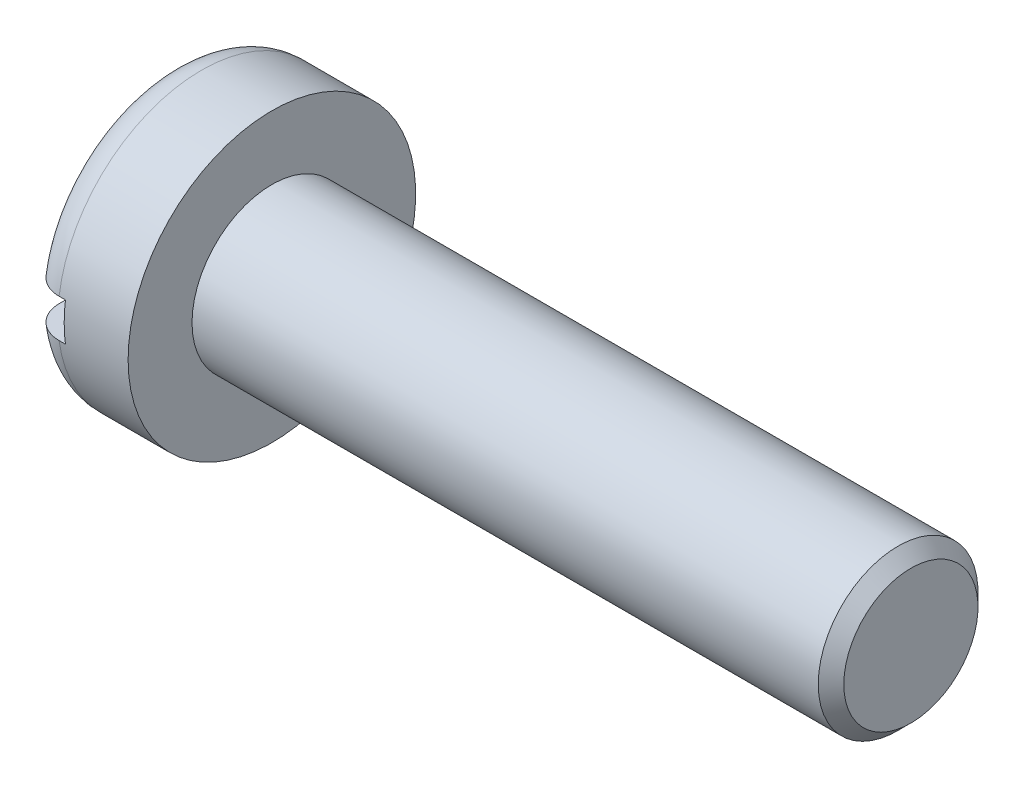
ISO-10303-21;
HEADER;
FILE_DESCRIPTION(('STEP AP214'),'2;1');
FILE_NAME('part.step','',(''),(''),'','','');
FILE_SCHEMA(('AUTOMOTIVE_DESIGN { 1 0 10303 214 1 1 1 1 }'));
ENDSEC;
DATA;
#1=APPLICATION_CONTEXT('core data for automotive mechanical design processes');
#2=APPLICATION_PROTOCOL_DEFINITION('international standard','automotive_design',2000,#1);
#3=PRODUCT_CONTEXT('',#1,'mechanical');
#4=PRODUCT('Part','Part','',(#3));
#5=PRODUCT_RELATED_PRODUCT_CATEGORY('part','',(#4));
#6=PRODUCT_DEFINITION_FORMATION('','',#4);
#7=PRODUCT_DEFINITION_CONTEXT('part definition',#1,'design');
#8=PRODUCT_DEFINITION('design','',#6,#7);
#9=PRODUCT_DEFINITION_SHAPE('','',#8);
#10=(LENGTH_UNIT() NAMED_UNIT(*) SI_UNIT(.MILLI.,.METRE.));
#11=(NAMED_UNIT(*) PLANE_ANGLE_UNIT() SI_UNIT($,.RADIAN.));
#12=(NAMED_UNIT(*) SI_UNIT($,.STERADIAN.) SOLID_ANGLE_UNIT());
#13=UNCERTAINTY_MEASURE_WITH_UNIT(LENGTH_MEASURE(1.E-05),#10,'distance_accuracy_value','');
#14=(GEOMETRIC_REPRESENTATION_CONTEXT(3) GLOBAL_UNCERTAINTY_ASSIGNED_CONTEXT((#13)) GLOBAL_UNIT_ASSIGNED_CONTEXT((#10,
#11,#12)) REPRESENTATION_CONTEXT('',''));
#15=CARTESIAN_POINT('',(0.,0.,0.));
#16=DIRECTION('',(0.,0.,1.));
#17=DIRECTION('',(1.,0.,0.));
#18=AXIS2_PLACEMENT_3D('',#15,#16,#17);
#19=CARTESIAN_POINT('',(-1.6,0.,0.));
#20=DIRECTION('',(1.,0.,0.));
#21=DIRECTION('',(0.,0.,-1.));
#22=AXIS2_PLACEMENT_3D('',#19,#20,#21);
#23=PLANE('',#22);
#24=CARTESIAN_POINT('',(-1.6,0.,0.));
#25=DIRECTION('',(1.,0.,0.));
#26=DIRECTION('',(0.,0.,-1.));
#27=AXIS2_PLACEMENT_3D('',#24,#25,#26);
#28=CIRCLE('',#27,1.75);
#29=CARTESIAN_POINT('',(-1.6,0.3,1.72409396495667));
#30=VERTEX_POINT('',#29);
#31=CARTESIAN_POINT('',(-1.6,0.3,-1.72409396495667));
#32=VERTEX_POINT('',#31);
#33=EDGE_CURVE('E129',#30,#32,#28,.F.);
#34=ORIENTED_EDGE('',*,*,#33,.T.);
#35=DIRECTION('',(0.,0.,1.));
#36=VECTOR('',#35,1.);
#37=CARTESIAN_POINT('',(-1.6,0.3,0.));
#38=LINE('',#37,#36);
#39=EDGE_CURVE('E105',#32,#30,#38,.T.);
#40=ORIENTED_EDGE('',*,*,#39,.T.);
#41=EDGE_LOOP('',(#34,#40));
#42=FACE_BOUND('',#41,.T.);
#43=ADVANCED_FACE('F32',(#42),#23,.F.);
#44=CARTESIAN_POINT('',(-1.1,0.,0.));
#45=DIRECTION('',(1.,0.,0.));
#46=DIRECTION('',(0.,0.,-1.));
#47=AXIS2_PLACEMENT_3D('',#44,#45,#46);
#48=TOROIDAL_SURFACE('',#47,1.75,0.5);
#49=CARTESIAN_POINT('',(-1.37484515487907,0.3,-2.14682441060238));
#50=CARTESIAN_POINT('',(-1.35159837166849,0.3,-2.16226847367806));
#51=CARTESIAN_POINT('',(-1.32703674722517,0.3,-2.17576843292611));
#52=CARTESIAN_POINT('',(-1.27597711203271,0.3,-2.19846715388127));
#53=CARTESIAN_POINT('',(-1.2494769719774,0.3,-2.2076611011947));
#54=CARTESIAN_POINT('',(-1.19531286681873,0.3,-2.22145970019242));
#55=CARTESIAN_POINT('',(-1.16764923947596,0.3,-2.22606567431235));
#56=CARTESIAN_POINT('',(-1.11194836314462,0.3,-2.23055342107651));
#57=CARTESIAN_POINT('',(-1.08391120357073,0.3,-2.23043630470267));
#58=CARTESIAN_POINT('',(-1.02832256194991,0.3,-2.22549062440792));
#59=CARTESIAN_POINT('',(-1.00077008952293,0.3,-2.22067318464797));
#60=CARTESIAN_POINT('',(-0.946863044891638,0.3,-2.20648531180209));
#61=CARTESIAN_POINT('',(-0.9205085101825,0.3,-2.19711473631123));
#62=CARTESIAN_POINT('',(-0.869713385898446,0.3,-2.17408401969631));
#63=CARTESIAN_POINT('',(-0.845274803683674,0.3,-2.16041945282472));
#64=CARTESIAN_POINT('',(-0.799022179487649,0.3,-2.12920293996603));
#65=CARTESIAN_POINT('',(-0.777208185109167,0.3,-2.11165092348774));
#66=CARTESIAN_POINT('',(-0.736688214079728,0.3,-2.07305801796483));
#67=CARTESIAN_POINT('',(-0.718000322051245,0.3,-2.05199814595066));
#68=CARTESIAN_POINT('',(-0.684386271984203,0.3,-2.00706528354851));
#69=CARTESIAN_POINT('',(-0.669460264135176,0.3,-1.98319218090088));
#70=CARTESIAN_POINT('',(-0.643637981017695,0.3,-1.9330703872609));
#71=CARTESIAN_POINT('',(-0.632781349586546,0.3,-1.90680127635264));
#72=CARTESIAN_POINT('',(-0.615575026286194,0.3,-1.85282685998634));
#73=CARTESIAN_POINT('',(-0.609225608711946,0.3,-1.82512146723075));
#74=CARTESIAN_POINT('',(-0.601134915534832,0.3,-1.76871209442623));
#75=CARTESIAN_POINT('',(-0.599448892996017,0.3,-1.74000018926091));
#76=CARTESIAN_POINT('',(-0.600866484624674,0.3,-1.68269474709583));
#77=CARTESIAN_POINT('',(-0.603970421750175,0.3,-1.6541012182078));
#78=CARTESIAN_POINT('',(-0.614926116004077,0.3,-1.59752108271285));
#79=CARTESIAN_POINT('',(-0.622828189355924,0.3,-1.56954421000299));
#80=CARTESIAN_POINT('',(-0.64319886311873,0.3,-1.51530400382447));
#81=CARTESIAN_POINT('',(-0.655667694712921,0.3,-1.4890407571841));
#82=CARTESIAN_POINT('',(-0.684887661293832,0.3,-1.43888566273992));
#83=CARTESIAN_POINT('',(-0.701654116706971,0.3,-1.41500273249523));
#84=CARTESIAN_POINT('',(-0.738996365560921,0.3,-1.3704249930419));
#85=CARTESIAN_POINT('',(-0.759572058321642,0.3,-1.3497300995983));
#86=CARTESIAN_POINT('',(-0.803744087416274,0.3,-1.31236659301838));
#87=CARTESIAN_POINT('',(-0.827307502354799,0.3,-1.2956590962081));
#88=CARTESIAN_POINT('',(-0.87696028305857,0.3,-1.26655119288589));
#89=CARTESIAN_POINT('',(-0.903049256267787,0.3,-1.25415011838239));
#90=CARTESIAN_POINT('',(-0.956342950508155,0.3,-1.23433270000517));
#91=CARTESIAN_POINT('',(-0.983505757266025,0.3,-1.22680366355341));
#92=CARTESIAN_POINT('',(-1.03872085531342,0.3,-1.21653349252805));
#93=CARTESIAN_POINT('',(-1.06677299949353,0.3,-1.21379157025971));
#94=CARTESIAN_POINT('',(-1.1222826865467,0.3,-1.21320213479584));
#95=CARTESIAN_POINT('',(-1.14973911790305,0.3,-1.2152438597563));
#96=CARTESIAN_POINT('',(-1.20391503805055,0.3,-1.22391943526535));
#97=CARTESIAN_POINT('',(-1.2306345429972,0.3,-1.23055318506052));
#98=CARTESIAN_POINT('',(-1.28254056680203,0.3,-1.24816695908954));
#99=CARTESIAN_POINT('',(-1.30772988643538,0.3,-1.25913874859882));
#100=CARTESIAN_POINT('',(-1.355961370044,0.3,-1.28507281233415));
#101=CARTESIAN_POINT('',(-1.37900332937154,0.3,-1.30003546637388));
#102=CARTESIAN_POINT('',(-1.42279768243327,0.3,-1.33384228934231));
#103=CARTESIAN_POINT('',(-1.4434935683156,0.3,-1.35275962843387));
#104=CARTESIAN_POINT('',(-1.48151295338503,0.3,-1.39372385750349));
#105=CARTESIAN_POINT('',(-1.49883601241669,0.3,-1.41577115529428));
#106=CARTESIAN_POINT('',(-1.53006409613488,0.3,-1.46296912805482));
#107=CARTESIAN_POINT('',(-1.54387250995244,0.3,-1.4881837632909));
#108=CARTESIAN_POINT('',(-1.56712734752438,0.3,-1.54055072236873));
#109=CARTESIAN_POINT('',(-1.57657339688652,0.3,-1.56770321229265));
#110=CARTESIAN_POINT('',(-1.59094414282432,0.3,-1.62357876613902));
#111=CARTESIAN_POINT('',(-1.59580506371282,0.3,-1.65231826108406));
#112=CARTESIAN_POINT('',(-1.60062987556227,0.3,-1.71020521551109));
#113=CARTESIAN_POINT('',(-1.60059390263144,0.3,-1.7393526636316));
#114=CARTESIAN_POINT('',(-1.59560663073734,0.3,-1.79720041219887));
#115=CARTESIAN_POINT('',(-1.59065948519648,0.3,-1.82590106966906));
#116=CARTESIAN_POINT('',(-1.57596753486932,0.3,-1.88205618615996));
#117=CARTESIAN_POINT('',(-1.56622174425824,0.3,-1.90951038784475));
#118=CARTESIAN_POINT('',(-1.54230058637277,0.3,-1.96210966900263));
#119=CARTESIAN_POINT('',(-1.52816662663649,0.3,-1.98727360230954));
#120=CARTESIAN_POINT('',(-1.49583411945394,0.3,-2.0348084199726));
#121=CARTESIAN_POINT('',(-1.47764077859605,0.3,-2.05718282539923));
#122=CARTESIAN_POINT('',(-1.44517001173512,0.3,-2.09077434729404));
#123=CARTESIAN_POINT('',(-1.43196062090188,0.3,-2.10304166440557));
#124=CARTESIAN_POINT('',(-1.40429835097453,0.3,-2.12608393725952));
#125=CARTESIAN_POINT('',(-1.38984548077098,0.3,-2.13685890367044));
#126=CARTESIAN_POINT('',(-1.37484515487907,0.3,-2.14682441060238));
#127=B_SPLINE_CURVE_WITH_KNOTS('',3,(#49,#50,#51,#52,#53,#54,#55,#56,#57,#58,#59,#60,#61,#62,
#63,#64,#65,#66,#67,#68,#69,#70,#71,#72,#73,#74,#75,#76,#77,#78,#79,#80,#81,#82,#83,#84,#85,#86,
#87,#88,#89,#90,#91,#92,#93,#94,#95,#96,#97,#98,#99,#100,#101,#102,#103,#104,#105,#106,#107,
#108,#109,#110,#111,#112,#113,#114,#115,#116,#117,#118,#119,#120,#121,#122,#123,#124,#125,#126),
.UNSPECIFIED.,.T.,.F.,(4,2,2,2,2,2,2,2,2,2,2,2,2,2,2,2,2,2,2,2,2,2,2,2,2,2,2,2,2,2,2,2,2,2,2,2,
2,2,4),(0.,0.0836627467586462,0.167418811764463,0.251150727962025,0.334862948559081,
0.418377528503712,0.501894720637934,0.585498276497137,0.669103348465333,0.753176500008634,
0.837253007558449,0.922128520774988,1.00700919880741,1.0928913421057,1.17877927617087,
1.26558382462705,1.35239276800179,1.43951558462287,1.52663609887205,1.612868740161,
1.69908799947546,1.78323402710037,1.86736620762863,1.94956968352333,2.03177135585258,
2.11381773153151,2.1958719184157,2.27960538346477,2.36334976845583,2.44919427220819,
2.53504614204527,2.62207526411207,2.70910196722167,2.79605513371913,2.88302617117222,
2.96920027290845,3.05526447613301,3.10924946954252,3.16323407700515),.UNSPECIFIED.);
#128=CARTESIAN_POINT('',(-1.09999999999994,0.3,-2.22991031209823));
#129=VERTEX_POINT('',#128);
#130=EDGE_CURVE('E55',#32,#129,#127,.T.);
#131=ORIENTED_EDGE('',*,*,#130,.F.);
#132=ORIENTED_EDGE('',*,*,#33,.F.);
#133=CARTESIAN_POINT('',(-1.34281787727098,0.3,1.27818514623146));
#134=CARTESIAN_POINT('',(-1.31890863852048,0.3,1.26454281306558));
#135=CARTESIAN_POINT('',(-1.29385190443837,0.3,1.25287702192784));
#136=CARTESIAN_POINT('',(-1.24212233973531,0.3,1.23389258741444));
#137=CARTESIAN_POINT('',(-1.21544810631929,0.3,1.22657777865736));
#138=CARTESIAN_POINT('',(-1.16123621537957,0.3,1.21655743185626));
#139=CARTESIAN_POINT('',(-1.133698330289,0.3,1.21385311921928));
#140=CARTESIAN_POINT('',(-1.07856921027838,0.3,1.21315661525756));
#141=CARTESIAN_POINT('',(-1.05097798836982,0.3,1.21516339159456));
#142=CARTESIAN_POINT('',(-0.996779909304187,0.3,1.22377481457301));
#143=CARTESIAN_POINT('',(-0.97016642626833,0.3,1.23033790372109));
#144=CARTESIAN_POINT('',(-0.9184000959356,0.3,1.24779314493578));
#145=CARTESIAN_POINT('',(-0.893247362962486,0.3,1.25868563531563));
#146=CARTESIAN_POINT('',(-0.84481631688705,0.3,1.28458449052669));
#147=CARTESIAN_POINT('',(-0.821560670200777,0.3,1.29963319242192));
#148=CARTESIAN_POINT('',(-0.77782373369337,0.3,1.33333003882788));
#149=CARTESIAN_POINT('',(-0.757342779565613,0.3,1.35197861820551));
#150=CARTESIAN_POINT('',(-0.719186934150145,0.3,1.39285292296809));
#151=CARTESIAN_POINT('',(-0.701596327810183,0.3,1.41515733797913));
#152=CARTESIAN_POINT('',(-0.670317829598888,0.3,1.4623528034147));
#153=CARTESIAN_POINT('',(-0.65663037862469,0.3,1.48724414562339));
#154=CARTESIAN_POINT('',(-0.633271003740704,0.3,1.53946627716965));
#155=CARTESIAN_POINT('',(-0.623687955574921,0.3,1.56683686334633));
#156=CARTESIAN_POINT('',(-0.609220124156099,0.3,1.6227936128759));
#157=CARTESIAN_POINT('',(-0.60433556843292,0.3,1.65137983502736));
#158=CARTESIAN_POINT('',(-0.599397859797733,0.3,1.70914687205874));
#159=CARTESIAN_POINT('',(-0.599374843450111,0.3,1.73833027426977));
#160=CARTESIAN_POINT('',(-0.604259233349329,0.3,1.79628240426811));
#161=CARTESIAN_POINT('',(-0.609166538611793,0.3,1.82505114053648));
#162=CARTESIAN_POINT('',(-0.623753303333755,0.3,1.88116795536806));
#163=CARTESIAN_POINT('',(-0.633403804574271,0.3,1.90852355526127));
#164=CARTESIAN_POINT('',(-0.657213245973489,0.3,1.96119763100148));
#165=CARTESIAN_POINT('',(-0.671371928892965,0.3,1.986516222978));
#166=CARTESIAN_POINT('',(-0.70362220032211,0.3,2.03408512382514));
#167=CARTESIAN_POINT('',(-0.721666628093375,0.3,2.05636740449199));
#168=CARTESIAN_POINT('',(-0.761279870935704,0.3,2.09754174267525));
#169=CARTESIAN_POINT('',(-0.782848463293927,0.3,2.11643401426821));
#170=CARTESIAN_POINT('',(-0.828629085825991,0.3,2.15006431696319));
#171=CARTESIAN_POINT('',(-0.852807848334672,0.3,2.16484764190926));
#172=CARTESIAN_POINT('',(-0.903320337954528,0.3,2.19010469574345));
#173=CARTESIAN_POINT('',(-0.929653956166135,0.3,2.20057864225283));
#174=CARTESIAN_POINT('',(-0.983487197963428,0.3,2.21683262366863));
#175=CARTESIAN_POINT('',(-1.01097501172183,0.3,2.22265178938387));
#176=CARTESIAN_POINT('',(-1.0665380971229,0.3,2.2295710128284));
#177=CARTESIAN_POINT('',(-1.0946133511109,0.3,2.23067121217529));
#178=CARTESIAN_POINT('',(-1.15042851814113,0.3,2.22812537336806));
#179=CARTESIAN_POINT('',(-1.17816934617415,0.3,2.22449933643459));
#180=CARTESIAN_POINT('',(-1.2326485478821,0.3,2.21264313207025));
#181=CARTESIAN_POINT('',(-1.25938692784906,0.3,2.20441299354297));
#182=CARTESIAN_POINT('',(-1.31111864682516,0.3,2.18358624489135));
#183=CARTESIAN_POINT('',(-1.3361111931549,0.3,2.17098766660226));
#184=CARTESIAN_POINT('',(-1.38364030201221,0.3,2.14179343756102));
#185=CARTESIAN_POINT('',(-1.40617682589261,0.3,2.12519772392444));
#186=CARTESIAN_POINT('',(-1.44828064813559,0.3,2.08839661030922));
#187=CARTESIAN_POINT('',(-1.46783241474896,0.3,2.06817344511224));
#188=CARTESIAN_POINT('',(-1.50329953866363,0.3,2.02475741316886));
#189=CARTESIAN_POINT('',(-1.51921474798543,0.3,2.00156442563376));
#190=CARTESIAN_POINT('',(-1.54711551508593,0.3,1.95264517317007));
#191=CARTESIAN_POINT('',(-1.55906414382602,0.3,1.92689785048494));
#192=CARTESIAN_POINT('',(-1.57852505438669,0.3,1.87377848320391));
#193=CARTESIAN_POINT('',(-1.58603707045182,0.3,1.84640634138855));
#194=CARTESIAN_POINT('',(-1.59650501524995,0.3,1.79047368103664));
#195=CARTESIAN_POINT('',(-1.59940676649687,0.3,1.76190302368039));
#196=CARTESIAN_POINT('',(-1.60042902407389,0.3,1.70467735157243));
#197=CARTESIAN_POINT('',(-1.5985493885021,0.3,1.67602233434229));
#198=CARTESIAN_POINT('',(-1.59003155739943,0.3,1.61910589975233));
#199=CARTESIAN_POINT('',(-1.58334129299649,0.3,1.59085226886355));
#200=CARTESIAN_POINT('',(-1.56533478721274,0.3,1.53585010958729));
#201=CARTESIAN_POINT('',(-1.55401717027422,0.3,1.50910203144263));
#202=CARTESIAN_POINT('',(-1.5269936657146,0.3,1.45773924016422));
#203=CARTESIAN_POINT('',(-1.51126444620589,0.3,1.43313680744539));
#204=CARTESIAN_POINT('',(-1.47587761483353,0.3,1.38697049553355));
#205=CARTESIAN_POINT('',(-1.45622470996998,0.3,1.36540302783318));
#206=CARTESIAN_POINT('',(-1.42088126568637,0.3,1.33273859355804));
#207=CARTESIAN_POINT('',(-1.40614830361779,0.3,1.32058969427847));
#208=CARTESIAN_POINT('',(-1.37539981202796,0.3,1.2980392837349));
#209=CARTESIAN_POINT('',(-1.35938429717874,0.3,1.28763775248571));
#210=CARTESIAN_POINT('',(-1.34281787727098,0.3,1.27818514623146));
#211=B_SPLINE_CURVE_WITH_KNOTS('',3,(#133,#134,#135,#136,#137,#138,#139,#140,#141,#142,#143,
#144,#145,#146,#147,#148,#149,#150,#151,#152,#153,#154,#155,#156,#157,#158,#159,#160,#161,#162,
#163,#164,#165,#166,#167,#168,#169,#170,#171,#172,#173,#174,#175,#176,#177,#178,#179,#180,#181,
#182,#183,#184,#185,#186,#187,#188,#189,#190,#191,#192,#193,#194,#195,#196,#197,#198,#199,#200,
#201,#202,#203,#204,#205,#206,#207,#208,#209,#210),.UNSPECIFIED.,.T.,.F.,(4,2,2,2,2,2,2,2,2,2,2,
2,2,2,2,2,2,2,2,2,2,2,2,2,2,2,2,2,2,2,2,2,2,2,2,2,2,2,4),(0.,0.0825149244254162,
0.165102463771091,0.247711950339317,0.330303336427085,0.412151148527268,0.494005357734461,
0.576726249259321,0.659457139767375,0.744285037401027,0.829122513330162,0.91571407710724,
1.00230983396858,1.08944238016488,1.17657314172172,1.26317843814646,1.34977879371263,
1.4353820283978,1.52097985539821,1.60559287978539,1.69020163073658,1.77409140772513,
1.85797866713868,1.94151206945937,2.02504494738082,2.10861550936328,2.19218738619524,
2.27618031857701,2.36017666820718,2.44493442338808,2.52969725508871,2.61544899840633,
2.70120328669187,2.78790000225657,2.87462250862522,2.96181261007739,3.04889873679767,
3.10607297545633,3.16324656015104),.UNSPECIFIED.);
#212=CARTESIAN_POINT('',(-1.1,0.3,2.22991031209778));
#213=VERTEX_POINT('',#212);
#214=EDGE_CURVE('E158',#213,#30,#211,.T.);
#215=ORIENTED_EDGE('',*,*,#214,.F.);
#216=CARTESIAN_POINT('',(-1.1,0.,0.));
#217=DIRECTION('',(1.,0.,0.));
#218=DIRECTION('',(0.,0.,-1.));
#219=AXIS2_PLACEMENT_3D('',#216,#217,#218);
#220=CIRCLE('',#219,2.25);
#221=EDGE_CURVE('E133',#129,#213,#220,.T.);
#222=ORIENTED_EDGE('',*,*,#221,.F.);
#223=EDGE_LOOP('',(#131,#132,#215,#222));
#224=FACE_BOUND('',#223,.T.);
#225=ADVANCED_FACE('F171',(#224),#48,.T.);
#226=CARTESIAN_POINT('',(10.,1.25,0.));
#227=DIRECTION('',(-1.,0.,0.));
#228=DIRECTION('',(0.,0.,1.));
#229=AXIS2_PLACEMENT_3D('',#226,#227,#228);
#230=PLANE('',#229);
#231=CARTESIAN_POINT('',(10.,0.,0.));
#232=DIRECTION('',(-1.,0.,0.));
#233=DIRECTION('',(0.,0.,1.));
#234=AXIS2_PLACEMENT_3D('',#231,#232,#233);
#235=CIRCLE('',#234,1.05000000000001);
#236=CARTESIAN_POINT('',(10.,0.,1.05000000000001));
#237=VERTEX_POINT('',#236);
#238=EDGE_CURVE('E126',#237,#237,#235,.F.);
#239=ORIENTED_EDGE('',*,*,#238,.T.);
#240=EDGE_LOOP('',(#239));
#241=FACE_BOUND('',#240,.T.);
#242=ADVANCED_FACE('F34',(#241),#230,.F.);
#243=CARTESIAN_POINT('',(-28.9826848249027,0.,0.));
#244=DIRECTION('',(-1.,0.,0.));
#245=DIRECTION('',(0.,0.,1.));
#246=AXIS2_PLACEMENT_3D('',#243,#244,#245);
#247=CYLINDRICAL_SURFACE('',#246,1.25);
#248=CARTESIAN_POINT('',(9.8,0.,0.));
#249=DIRECTION('',(-1.,0.,0.));
#250=DIRECTION('',(0.,0.,1.));
#251=AXIS2_PLACEMENT_3D('',#248,#249,#250);
#252=CIRCLE('',#251,1.25);
#253=CARTESIAN_POINT('',(9.8,0.,1.25));
#254=VERTEX_POINT('',#253);
#255=EDGE_CURVE('E123',#254,#254,#252,.T.);
#256=ORIENTED_EDGE('',*,*,#255,.T.);
#257=EDGE_LOOP('',(#256));
#258=FACE_BOUND('',#257,.T.);
#259=CARTESIAN_POINT('',(0.,0.,0.));
#260=DIRECTION('',(-1.,0.,0.));
#261=DIRECTION('',(0.,0.,1.));
#262=AXIS2_PLACEMENT_3D('',#259,#260,#261);
#263=CIRCLE('',#262,1.25);
#264=CARTESIAN_POINT('',(0.,0.,1.25));
#265=VERTEX_POINT('',#264);
#266=EDGE_CURVE('E120',#265,#265,#263,.T.);
#267=ORIENTED_EDGE('',*,*,#266,.F.);
#268=EDGE_LOOP('',(#267));
#269=FACE_BOUND('',#268,.T.);
#270=ADVANCED_FACE('F192',(#258,#269),#247,.T.);
#271=CARTESIAN_POINT('',(0.,2.25,0.));
#272=DIRECTION('',(-1.,0.,0.));
#273=DIRECTION('',(0.,0.,1.));
#274=AXIS2_PLACEMENT_3D('',#271,#272,#273);
#275=PLANE('',#274);
#276=CARTESIAN_POINT('',(0.,0.,0.));
#277=DIRECTION('',(-1.,0.,0.));
#278=DIRECTION('',(0.,0.,1.));
#279=AXIS2_PLACEMENT_3D('',#276,#277,#278);
#280=CIRCLE('',#279,2.25);
#281=CARTESIAN_POINT('',(0.,0.,2.25));
#282=VERTEX_POINT('',#281);
#283=EDGE_CURVE('E117',#282,#282,#280,.T.);
#284=ORIENTED_EDGE('',*,*,#283,.F.);
#285=EDGE_LOOP('',(#284));
#286=FACE_BOUND('',#285,.T.);
#287=ORIENTED_EDGE('',*,*,#266,.T.);
#288=EDGE_LOOP('',(#287));
#289=FACE_BOUND('',#288,.T.);
#290=ADVANCED_FACE('F188',(#286,#289),#275,.F.);
#291=CARTESIAN_POINT('',(-28.9826848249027,0.,0.));
#292=DIRECTION('',(-1.,0.,0.));
#293=DIRECTION('',(0.,0.,1.));
#294=AXIS2_PLACEMENT_3D('',#291,#292,#293);
#295=CYLINDRICAL_SURFACE('',#294,2.25);
#296=ORIENTED_EDGE('',*,*,#221,.T.);
#297=DIRECTION('',(-1.,0.,0.));
#298=VECTOR('',#297,1.);
#299=CARTESIAN_POINT('',(-28.9826848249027,0.3,2.22991031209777));
#300=LINE('',#299,#298);
#301=CARTESIAN_POINT('',(-1.,0.3,2.22991031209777));
#302=VERTEX_POINT('',#301);
#303=EDGE_CURVE('E108',#213,#302,#300,.F.);
#304=ORIENTED_EDGE('',*,*,#303,.T.);
#305=CARTESIAN_POINT('',(-1.,0.,0.));
#306=DIRECTION('',(1.,0.,0.));
#307=DIRECTION('',(0.,0.,-1.));
#308=AXIS2_PLACEMENT_3D('',#305,#306,#307);
#309=CIRCLE('',#308,2.25);
#310=CARTESIAN_POINT('',(-1.,-0.3,2.22991031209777));
#311=VERTEX_POINT('',#310);
#312=EDGE_CURVE('E11',#302,#311,#309,.T.);
#313=ORIENTED_EDGE('',*,*,#312,.T.);
#314=DIRECTION('',(-1.,0.,0.));
#315=VECTOR('',#314,1.);
#316=CARTESIAN_POINT('',(-28.9826848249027,-0.3,2.22991031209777));
#317=LINE('',#316,#315);
#318=CARTESIAN_POINT('',(-1.09999999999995,-0.3,2.22991031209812));
#319=VERTEX_POINT('',#318);
#320=EDGE_CURVE('E97',#311,#319,#317,.T.);
#321=ORIENTED_EDGE('',*,*,#320,.T.);
#322=CARTESIAN_POINT('',(-1.1,-0.3,-2.22991031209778));
#323=VERTEX_POINT('',#322);
#324=EDGE_CURVE('E104',#319,#323,#220,.T.);
#325=ORIENTED_EDGE('',*,*,#324,.T.);
#326=DIRECTION('',(-1.,0.,0.));
#327=VECTOR('',#326,1.);
#328=CARTESIAN_POINT('',(-28.9826848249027,-0.3,-2.22991031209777));
#329=LINE('',#328,#327);
#330=CARTESIAN_POINT('',(-1.,-0.3,-2.22991031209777));
#331=VERTEX_POINT('',#330);
#332=EDGE_CURVE('E94',#323,#331,#329,.F.);
#333=ORIENTED_EDGE('',*,*,#332,.T.);
#334=CARTESIAN_POINT('',(-1.,0.3,-2.22991031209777));
#335=VERTEX_POINT('',#334);
#336=EDGE_CURVE('E36',#331,#335,#309,.T.);
#337=ORIENTED_EDGE('',*,*,#336,.T.);
#338=DIRECTION('',(-1.,0.,0.));
#339=VECTOR('',#338,1.);
#340=CARTESIAN_POINT('',(-28.9826848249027,0.3,-2.22991031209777));
#341=LINE('',#340,#339);
#342=EDGE_CURVE('E115',#335,#129,#341,.T.);
#343=ORIENTED_EDGE('',*,*,#342,.T.);
#344=EDGE_LOOP('',(#296,#304,#313,#321,#325,#333,#337,#343));
#345=FACE_BOUND('',#344,.T.);
#346=ORIENTED_EDGE('',*,*,#283,.T.);
#347=EDGE_LOOP('',(#346));
#348=FACE_BOUND('',#347,.T.);
#349=ADVANCED_FACE('F101',(#345,#348),#295,.T.);
#350=CARTESIAN_POINT('',(-1.6,-0.3,-1.72409396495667));
#351=VERTEX_POINT('',#350);
#352=CARTESIAN_POINT('',(-1.6,-0.3,1.72409396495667));
#353=VERTEX_POINT('',#352);
#354=EDGE_CURVE('E130',#351,#353,#28,.F.);
#355=ORIENTED_EDGE('',*,*,#354,.T.);
#356=DIRECTION('',(0.,0.,-1.));
#357=VECTOR('',#356,1.);
#358=CARTESIAN_POINT('',(-1.6,-0.3,0.));
#359=LINE('',#358,#357);
#360=EDGE_CURVE('E47',#353,#351,#359,.T.);
#361=ORIENTED_EDGE('',*,*,#360,.T.);
#362=EDGE_LOOP('',(#355,#361));
#363=FACE_BOUND('',#362,.T.);
#364=ADVANCED_FACE('F167',(#363),#23,.F.);
#365=CARTESIAN_POINT('',(9.8,0.,0.));
#366=DIRECTION('',(-1.,0.,0.));
#367=DIRECTION('',(0.,0.,1.));
#368=AXIS2_PLACEMENT_3D('',#365,#366,#367);
#369=CONICAL_SURFACE('',#368,1.25,0.785398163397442);
#370=ORIENTED_EDGE('',*,*,#238,.F.);
#371=EDGE_LOOP('',(#370));
#372=FACE_BOUND('',#371,.T.);
#373=ORIENTED_EDGE('',*,*,#255,.F.);
#374=EDGE_LOOP('',(#373));
#375=FACE_BOUND('',#374,.T.);
#376=ADVANCED_FACE('F182',(#372,#375),#369,.T.);
#377=CARTESIAN_POINT('',(-1.37484515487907,-0.3,-2.14682441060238));
#378=CARTESIAN_POINT('',(-1.39836348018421,-0.3,-2.13119687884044));
#379=CARTESIAN_POINT('',(-1.42057033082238,-0.3,-2.11355618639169));
#380=CARTESIAN_POINT('',(-1.46171480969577,-0.3,-2.07477166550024));
#381=CARTESIAN_POINT('',(-1.48064813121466,-0.3,-2.05362329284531));
#382=CARTESIAN_POINT('',(-1.5146878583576,-0.3,-2.00847254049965));
#383=CARTESIAN_POINT('',(-1.52979780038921,-0.3,-1.9844728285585));
#384=CARTESIAN_POINT('',(-1.55580649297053,-0.3,-1.93430108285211));
#385=CARTESIAN_POINT('',(-1.56670627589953,-0.3,-1.90812958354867));
#386=CARTESIAN_POINT('',(-1.58409678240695,-0.3,-1.85412319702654));
#387=CARTESIAN_POINT('',(-1.59055051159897,-0.3,-1.82627640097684));
#388=CARTESIAN_POINT('',(-1.59875129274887,-0.3,-1.76989727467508));
#389=CARTESIAN_POINT('',(-1.60049784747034,-0.3,-1.74136487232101));
#390=CARTESIAN_POINT('',(-1.59925089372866,-0.3,-1.68406606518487));
#391=CARTESIAN_POINT('',(-1.59620111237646,-0.3,-1.65530088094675));
#392=CARTESIAN_POINT('',(-1.58535661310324,-0.3,-1.59867861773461));
#393=CARTESIAN_POINT('',(-1.57756159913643,-0.3,-1.5708215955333));
#394=CARTESIAN_POINT('',(-1.55736389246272,-0.3,-1.51657298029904));
#395=CARTESIAN_POINT('',(-1.5449244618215,-0.3,-1.490195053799));
#396=CARTESIAN_POINT('',(-1.5157840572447,-0.3,-1.43990636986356));
#397=CARTESIAN_POINT('',(-1.4990829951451,-0.3,-1.41599566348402));
#398=CARTESIAN_POINT('',(-1.4619149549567,-0.3,-1.37140493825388));
#399=CARTESIAN_POINT('',(-1.44145750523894,-0.3,-1.35071698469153));
#400=CARTESIAN_POINT('',(-1.39730442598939,-0.3,-1.31314339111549));
#401=CARTESIAN_POINT('',(-1.37360908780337,-0.3,-1.29625740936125));
#402=CARTESIAN_POINT('',(-1.32409428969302,-0.3,-1.26711135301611));
#403=CARTESIAN_POINT('',(-1.29832033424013,-0.3,-1.25477403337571));
#404=CARTESIAN_POINT('',(-1.24502940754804,-0.3,-1.23473547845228));
#405=CARTESIAN_POINT('',(-1.21751276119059,-0.3,-1.22703338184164));
#406=CARTESIAN_POINT('',(-1.16229297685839,-0.3,-1.21668377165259));
#407=CARTESIAN_POINT('',(-1.13461365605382,-0.3,-1.21390899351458));
#408=CARTESIAN_POINT('',(-1.07918879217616,-0.3,-1.21312135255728));
#409=CARTESIAN_POINT('',(-1.05144325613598,-0.3,-1.21510800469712));
#410=CARTESIAN_POINT('',(-0.997089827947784,-0.3,-1.22370750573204));
#411=CARTESIAN_POINT('',(-0.970471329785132,-0.3,-1.23025363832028));
#412=CARTESIAN_POINT('',(-0.918692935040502,-0.3,-1.2476760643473));
#413=CARTESIAN_POINT('',(-0.893533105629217,-0.3,-1.25855255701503));
#414=CARTESIAN_POINT('',(-0.845086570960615,-0.3,-1.28442026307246));
#415=CARTESIAN_POINT('',(-0.821822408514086,-0.3,-1.29945364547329));
#416=CARTESIAN_POINT('',(-0.778066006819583,-0.3,-1.33312151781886));
#417=CARTESIAN_POINT('',(-0.757574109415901,-0.3,-1.35175645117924));
#418=CARTESIAN_POINT('',(-0.71939421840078,-0.3,-1.39260488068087));
#419=CARTESIAN_POINT('',(-0.701790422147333,-0.3,-1.41489708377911));
#420=CARTESIAN_POINT('',(-0.670483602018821,-0.3,-1.46207042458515));
#421=CARTESIAN_POINT('',(-0.65678102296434,-0.3,-1.48695185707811));
#422=CARTESIAN_POINT('',(-0.63338921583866,-0.3,-1.53915712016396));
#423=CARTESIAN_POINT('',(-0.62378892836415,-0.3,-1.56652084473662));
#424=CARTESIAN_POINT('',(-0.609285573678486,-0.3,-1.62246680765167));
#425=CARTESIAN_POINT('',(-0.604382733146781,-0.3,-1.65104910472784));
#426=CARTESIAN_POINT('',(-0.599407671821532,-0.3,-1.70881222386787));
#427=CARTESIAN_POINT('',(-0.599365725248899,-0.3,-1.7379956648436));
#428=CARTESIAN_POINT('',(-0.60421244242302,-0.3,-1.79595106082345));
#429=CARTESIAN_POINT('',(-0.60910100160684,-0.3,-1.8247230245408));
#430=CARTESIAN_POINT('',(-0.623651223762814,-0.3,-1.88084991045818));
#431=CARTESIAN_POINT('',(-0.633284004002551,-0.3,-1.90821231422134));
#432=CARTESIAN_POINT('',(-0.657059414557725,-0.3,-1.96090297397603));
#433=CARTESIAN_POINT('',(-0.671201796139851,-0.3,-1.98623134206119));
#434=CARTESIAN_POINT('',(-0.703421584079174,-0.3,-2.03382238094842));
#435=CARTESIAN_POINT('',(-0.721451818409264,-0.3,-2.05611698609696));
#436=CARTESIAN_POINT('',(-0.761039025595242,-0.3,-2.09731823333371));
#437=CARTESIAN_POINT('',(-0.782595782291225,-0.3,-2.1162250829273));
#438=CARTESIAN_POINT('',(-0.828355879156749,-0.3,-2.1498864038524));
#439=CARTESIAN_POINT('',(-0.852525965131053,-0.3,-2.16468608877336));
#440=CARTESIAN_POINT('',(-0.903023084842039,-0.3,-2.18997643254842));
#441=CARTESIAN_POINT('',(-0.929349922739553,-0.3,-2.20046748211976));
#442=CARTESIAN_POINT('',(-0.983169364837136,-0.3,-2.21675563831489));
#443=CARTESIAN_POINT('',(-1.01064997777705,-0.3,-2.22259238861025));
#444=CARTESIAN_POINT('',(-1.06620950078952,-0.3,-2.22954879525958));
#445=CARTESIAN_POINT('',(-1.094288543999,-0.3,-2.23066739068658));
#446=CARTESIAN_POINT('',(-1.15012505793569,-0.3,-2.22815757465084));
#447=CARTESIAN_POINT('',(-1.17788333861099,-0.3,-2.2245469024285));
#448=CARTESIAN_POINT('',(-1.23237493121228,-0.3,-2.21271718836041));
#449=CARTESIAN_POINT('',(-1.25910946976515,-0.3,-2.20450385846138));
#450=CARTESIAN_POINT('',(-1.30069099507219,-0.3,-2.18779684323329));
#451=CARTESIAN_POINT('',(-1.31610047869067,-0.3,-2.18066719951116));
#452=CARTESIAN_POINT('',(-1.34611281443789,-0.3,-2.16487538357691));
#453=CARTESIAN_POINT('',(-1.36071566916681,-0.3,-2.1562132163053));
#454=CARTESIAN_POINT('',(-1.37484515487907,-0.3,-2.14682441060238));
#455=B_SPLINE_CURVE_WITH_KNOTS('',3,(#377,#378,#379,#380,#381,#382,#383,#384,#385,#386,#387,
#388,#389,#390,#391,#392,#393,#394,#395,#396,#397,#398,#399,#400,#401,#402,#403,#404,#405,#406,
#407,#408,#409,#410,#411,#412,#413,#414,#415,#416,#417,#418,#419,#420,#421,#422,#423,#424,#425,
#426,#427,#428,#429,#430,#431,#432,#433,#434,#435,#436,#437,#438,#439,#440,#441,#442,#443,#444,
#445,#446,#447,#448,#449,#450,#451,#452,#453,#454),.UNSPECIFIED.,.T.,.F.,(4,2,2,2,2,2,2,2,2,2,2,
2,2,2,2,2,2,2,2,2,2,2,2,2,2,2,2,2,2,2,2,2,2,2,2,2,2,2,4),(0.,0.0846484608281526,
0.169407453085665,0.254087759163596,0.338747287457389,0.4241030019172,0.509467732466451,
0.595841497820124,0.682220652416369,0.769298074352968,0.856377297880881,0.943238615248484,
1.03009212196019,1.11539415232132,1.20068032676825,1.28372977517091,1.36677076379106,
1.44862150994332,1.53047602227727,1.61319345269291,1.69592107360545,1.78074475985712,
1.86557811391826,1.95216738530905,2.03876083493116,2.12589356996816,2.21302445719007,
2.29963133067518,2.3862334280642,2.47183860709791,2.55743854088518,2.6420549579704,
2.72666370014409,2.81054383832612,2.89444283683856,2.97802803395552,3.06150972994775,
3.11236552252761,3.16322115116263),.UNSPECIFIED.);
#456=EDGE_CURVE('E141',#323,#351,#455,.T.);
#457=ORIENTED_EDGE('',*,*,#456,.F.);
#458=ORIENTED_EDGE('',*,*,#324,.F.);
#459=CARTESIAN_POINT('',(-1.34281787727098,-0.3,1.27818514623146));
#460=CARTESIAN_POINT('',(-1.36759273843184,-0.3,1.29232426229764));
#461=CARTESIAN_POINT('',(-1.39117163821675,-0.3,1.30860721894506));
#462=CARTESIAN_POINT('',(-1.43526641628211,-0.3,1.34493322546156));
#463=CARTESIAN_POINT('',(-1.45577754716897,-0.3,1.3649819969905));
#464=CARTESIAN_POINT('',(-1.49314137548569,-0.3,1.40819108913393));
#465=CARTESIAN_POINT('',(-1.50999915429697,-0.3,1.43134701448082));
#466=CARTESIAN_POINT('',(-1.53964738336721,-0.3,1.48011869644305));
#467=CARTESIAN_POINT('',(-1.55243898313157,-0.3,1.50573375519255));
#468=CARTESIAN_POINT('',(-1.57377927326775,-0.3,1.55909974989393));
#469=CARTESIAN_POINT('',(-1.58226493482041,-0.3,1.58687591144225));
#470=CARTESIAN_POINT('',(-1.59447730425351,-0.3,1.64345788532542));
#471=CARTESIAN_POINT('',(-1.59820358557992,-0.3,1.672263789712));
#472=CARTESIAN_POINT('',(-1.60078270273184,-0.3,1.73022304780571));
#473=CARTESIAN_POINT('',(-1.59961378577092,-0.3,1.75937737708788));
#474=CARTESIAN_POINT('',(-1.59236217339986,-0.3,1.81706921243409));
#475=CARTESIAN_POINT('',(-1.58627961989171,-0.3,1.84560673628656));
#476=CARTESIAN_POINT('',(-1.56940841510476,-0.3,1.90103580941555));
#477=CARTESIAN_POINT('',(-1.55865327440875,-0.3,1.9279375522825));
#478=CARTESIAN_POINT('',(-1.53272664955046,-0.3,1.97952201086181));
#479=CARTESIAN_POINT('',(-1.5175554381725,-0.3,2.00420486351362));
#480=CARTESIAN_POINT('',(-1.48341816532,-0.3,2.05034069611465));
#481=CARTESIAN_POINT('',(-1.46449879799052,-0.3,2.07182822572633));
#482=CARTESIAN_POINT('',(-1.42328424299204,-0.3,2.1112769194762));
#483=CARTESIAN_POINT('',(-1.40098926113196,-0.3,2.12923829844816));
#484=CARTESIAN_POINT('',(-1.35392816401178,-0.3,2.16091382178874));
#485=CARTESIAN_POINT('',(-1.32919269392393,-0.3,2.17467350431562));
#486=CARTESIAN_POINT('',(-1.27774908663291,-0.3,2.19780600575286));
#487=CARTESIAN_POINT('',(-1.25104104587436,-0.3,2.20717903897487));
#488=CARTESIAN_POINT('',(-1.19664145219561,-0.3,2.22120016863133));
#489=CARTESIAN_POINT('',(-1.16895951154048,-0.3,2.22588557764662));
#490=CARTESIAN_POINT('',(-1.11320217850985,-0.3,2.23052357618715));
#491=CARTESIAN_POINT('',(-1.08512679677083,-0.3,2.23047629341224));
#492=CARTESIAN_POINT('',(-1.02948838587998,-0.3,2.22565945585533));
#493=CARTESIAN_POINT('',(-1.00192385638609,-0.3,2.2209072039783));
#494=CARTESIAN_POINT('',(-0.947982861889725,-0.3,2.20684680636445));
#495=CARTESIAN_POINT('',(-0.9216063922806,-0.3,2.19753867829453));
#496=CARTESIAN_POINT('',(-0.870757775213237,-0.3,2.17462841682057));
#497=CARTESIAN_POINT('',(-0.846287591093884,-0.3,2.16102192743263));
#498=CARTESIAN_POINT('',(-0.799962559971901,-0.3,2.12991534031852));
#499=CARTESIAN_POINT('',(-0.778107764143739,-0.3,2.11241516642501));
#500=CARTESIAN_POINT('',(-0.737498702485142,-0.3,2.07391918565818));
#501=CARTESIAN_POINT('',(-0.718762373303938,-0.3,2.05290446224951));
#502=CARTESIAN_POINT('',(-0.685044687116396,-0.3,2.00805311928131));
#503=CARTESIAN_POINT('',(-0.670063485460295,-0.3,1.98421638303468));
#504=CARTESIAN_POINT('',(-0.644125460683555,-0.3,1.93415853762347));
#505=CARTESIAN_POINT('',(-0.633208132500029,-0.3,1.90791696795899));
#506=CARTESIAN_POINT('',(-0.615876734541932,-0.3,1.85398719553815));
#507=CARTESIAN_POINT('',(-0.609462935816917,-0.3,1.82629890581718));
#508=CARTESIAN_POINT('',(-0.60124079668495,-0.3,1.76991320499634));
#509=CARTESIAN_POINT('',(-0.599487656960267,-0.3,1.74120774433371));
#510=CARTESIAN_POINT('',(-0.600770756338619,-0.3,1.68390397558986));
#511=CARTESIAN_POINT('',(-0.603807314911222,-0.3,1.65530567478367));
#512=CARTESIAN_POINT('',(-0.614629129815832,-0.3,1.59870402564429));
#513=CARTESIAN_POINT('',(-0.622464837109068,-0.3,1.57071031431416));
#514=CARTESIAN_POINT('',(-0.642706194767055,-0.3,1.51642536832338));
#515=CARTESIAN_POINT('',(-0.655112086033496,-0.3,1.49013422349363));
#516=CARTESIAN_POINT('',(-0.68421204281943,-0.3,1.4399108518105));
#517=CARTESIAN_POINT('',(-0.700921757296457,-0.3,1.41598768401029));
#518=CARTESIAN_POINT('',(-0.738157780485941,-0.3,1.3713199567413));
#519=CARTESIAN_POINT('',(-0.758683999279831,-0.3,1.35057532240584));
#520=CARTESIAN_POINT('',(-0.802769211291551,-0.3,1.31310196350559));
#521=CARTESIAN_POINT('',(-0.826295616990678,-0.3,1.29633493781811));
#522=CARTESIAN_POINT('',(-0.875884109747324,-0.3,1.26710288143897));
#523=CARTESIAN_POINT('',(-0.901945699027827,-0.3,1.25463700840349));
#524=CARTESIAN_POINT('',(-0.955195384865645,-0.3,1.23468782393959));
#525=CARTESIAN_POINT('',(-0.982341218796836,-0.3,1.22709171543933));
#526=CARTESIAN_POINT('',(-1.03754216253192,-0.3,1.21668428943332));
#527=CARTESIAN_POINT('',(-1.06559736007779,-0.3,1.21387343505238));
#528=CARTESIAN_POINT('',(-1.12113310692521,-0.3,1.21314928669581));
#529=CARTESIAN_POINT('',(-1.1486123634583,-0.3,1.21512708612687));
#530=CARTESIAN_POINT('',(-1.2028197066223,-0.3,1.22368300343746));
#531=CARTESIAN_POINT('',(-1.2295487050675,-0.3,1.2302552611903));
#532=CARTESIAN_POINT('',(-1.2706649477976,-0.3,1.24409820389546));
#533=CARTESIAN_POINT('',(-1.28555104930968,-0.3,1.24993494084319));
#534=CARTESIAN_POINT('',(-1.31468911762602,-0.3,1.26301866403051));
#535=CARTESIAN_POINT('',(-1.32894110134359,-0.3,1.27026561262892));
#536=CARTESIAN_POINT('',(-1.34281787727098,-0.3,1.27818514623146));
#537=B_SPLINE_CURVE_WITH_KNOTS('',3,(#459,#460,#461,#462,#463,#464,#465,#466,#467,#468,#469,
#470,#471,#472,#473,#474,#475,#476,#477,#478,#479,#480,#481,#482,#483,#484,#485,#486,#487,#488,
#489,#490,#491,#492,#493,#494,#495,#496,#497,#498,#499,#500,#501,#502,#503,#504,#505,#506,#507,
#508,#509,#510,#511,#512,#513,#514,#515,#516,#517,#518,#519,#520,#521,#522,#523,#524,#525,#526,
#527,#528,#529,#530,#531,#532,#533,#534,#535,#536),.UNSPECIFIED.,.T.,.F.,(4,2,2,2,2,2,2,2,2,2,2,
2,2,2,2,2,2,2,2,2,2,2,2,2,2,2,2,2,2,2,2,2,2,2,2,2,2,2,4),(0.,0.0855166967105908,
0.171164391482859,0.256692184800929,0.342195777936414,0.428917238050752,0.515646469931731,
0.602761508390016,0.689874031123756,0.776371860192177,0.862864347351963,0.948340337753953,
1.03381111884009,1.11831968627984,1.20282412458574,1.28665044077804,1.3704744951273,
1.45399142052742,1.53750802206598,1.62110953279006,1.70471267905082,1.78878121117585,
1.87285322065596,1.95772218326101,2.0425962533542,2.12847118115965,2.21435183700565,
2.30115118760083,2.38795511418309,2.47507923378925,2.56220130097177,2.64844690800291,
2.73467561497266,2.81882704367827,2.90298661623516,2.98525022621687,3.06740910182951,
3.11530958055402,3.16320878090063),.UNSPECIFIED.);
#538=EDGE_CURVE('E135',#353,#319,#537,.T.);
#539=ORIENTED_EDGE('',*,*,#538,.F.);
#540=ORIENTED_EDGE('',*,*,#354,.F.);
#541=EDGE_LOOP('',(#457,#458,#539,#540));
#542=FACE_BOUND('',#541,.T.);
#543=ADVANCED_FACE('F145',(#542),#48,.T.);
#544=CARTESIAN_POINT('',(-1.,0.3,-5.));
#545=DIRECTION('',(1.,0.,0.));
#546=DIRECTION('',(0.,0.,-1.));
#547=AXIS2_PLACEMENT_3D('',#544,#545,#546);
#548=PLANE('',#547);
#549=DIRECTION('',(0.,0.,1.));
#550=VECTOR('',#549,1.);
#551=CARTESIAN_POINT('',(-1.,0.3,-5.));
#552=LINE('',#551,#550);
#553=EDGE_CURVE('E90',#335,#302,#552,.T.);
#554=ORIENTED_EDGE('',*,*,#553,.F.);
#555=ORIENTED_EDGE('',*,*,#336,.F.);
#556=DIRECTION('',(0.,0.,1.));
#557=VECTOR('',#556,1.);
#558=CARTESIAN_POINT('',(-1.,-0.3,-5.));
#559=LINE('',#558,#557);
#560=EDGE_CURVE('E88',#331,#311,#559,.T.);
#561=ORIENTED_EDGE('',*,*,#560,.T.);
#562=ORIENTED_EDGE('',*,*,#312,.F.);
#563=EDGE_LOOP('',(#554,#555,#561,#562));
#564=FACE_BOUND('',#563,.T.);
#565=ADVANCED_FACE('F87',(#564),#548,.F.);
#566=CARTESIAN_POINT('',(-1.76785313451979,0.3,-5.));
#567=DIRECTION('',(0.,1.,0.));
#568=DIRECTION('',(0.,0.,1.));
#569=AXIS2_PLACEMENT_3D('',#566,#567,#568);
#570=PLANE('',#569);
#571=ORIENTED_EDGE('',*,*,#553,.T.);
#572=ORIENTED_EDGE('',*,*,#303,.F.);
#573=ORIENTED_EDGE('',*,*,#214,.T.);
#574=ORIENTED_EDGE('',*,*,#39,.F.);
#575=ORIENTED_EDGE('',*,*,#130,.T.);
#576=ORIENTED_EDGE('',*,*,#342,.F.);
#577=EDGE_LOOP('',(#571,#572,#573,#574,#575,#576));
#578=FACE_BOUND('',#577,.T.);
#579=ADVANCED_FACE('F151',(#578),#570,.F.);
#580=CARTESIAN_POINT('',(-1.,-0.3,-5.));
#581=DIRECTION('',(0.,-1.,0.));
#582=DIRECTION('',(0.,0.,-1.));
#583=AXIS2_PLACEMENT_3D('',#580,#581,#582);
#584=PLANE('',#583);
#585=ORIENTED_EDGE('',*,*,#456,.T.);
#586=ORIENTED_EDGE('',*,*,#360,.F.);
#587=ORIENTED_EDGE('',*,*,#538,.T.);
#588=ORIENTED_EDGE('',*,*,#320,.F.);
#589=ORIENTED_EDGE('',*,*,#560,.F.);
#590=ORIENTED_EDGE('',*,*,#332,.F.);
#591=EDGE_LOOP('',(#585,#586,#587,#588,#589,#590));
#592=FACE_BOUND('',#591,.T.);
#593=ADVANCED_FACE('F93',(#592),#584,.F.);
#594=CLOSED_SHELL('',(#43,#225,#242,#270,#290,#349,#364,#376,#543,#565,#579,#593));
#595=MANIFOLD_SOLID_BREP('B2',#594);
#596=ADVANCED_BREP_SHAPE_REPRESENTATION('',(#18,#595),#14);
#597=SHAPE_DEFINITION_REPRESENTATION(#9,#596);
ENDSEC;
END-ISO-10303-21;
